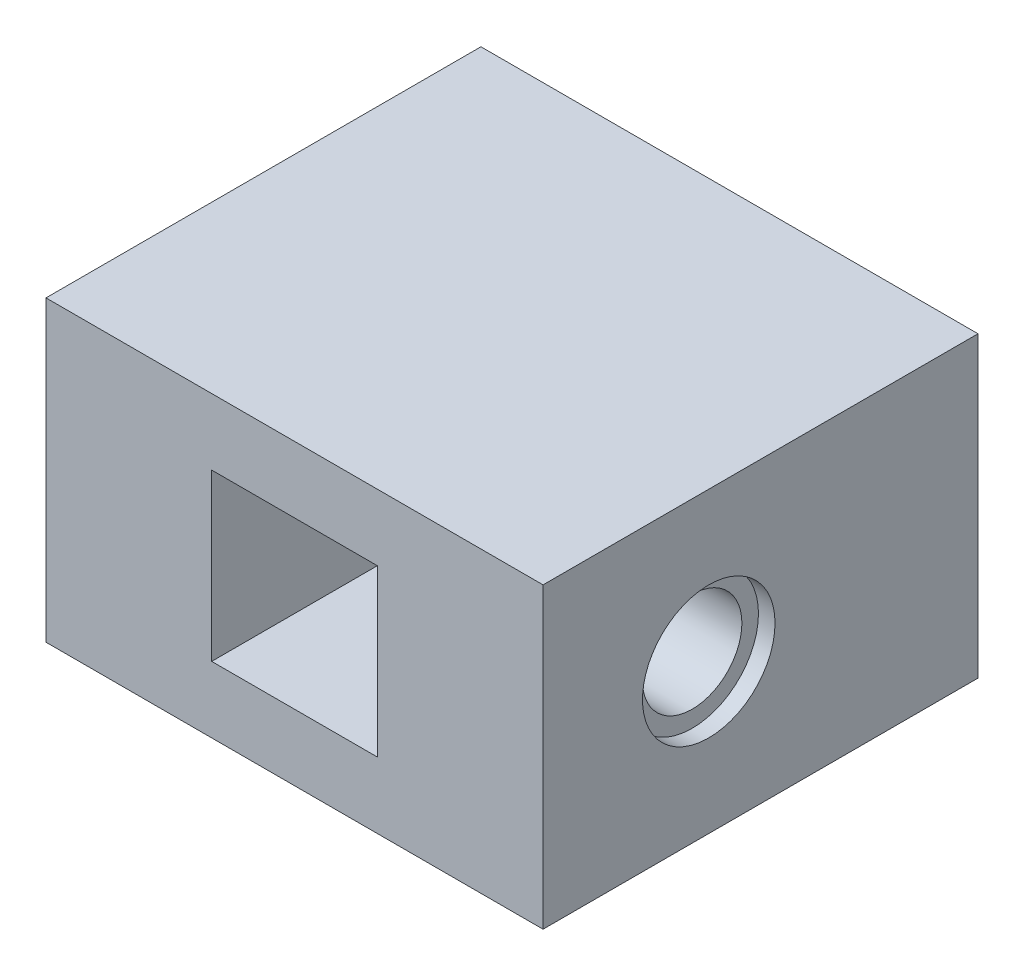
ISO-10303-21;
HEADER;
FILE_DESCRIPTION(('STEP AP214'),'2;1');
FILE_NAME('part.step','',(''),(''),'','','');
FILE_SCHEMA(('AUTOMOTIVE_DESIGN { 1 0 10303 214 1 1 1 1 }'));
ENDSEC;
DATA;
#1=APPLICATION_CONTEXT('core data for automotive mechanical design processes');
#2=APPLICATION_PROTOCOL_DEFINITION('international standard','automotive_design',2000,#1);
#3=PRODUCT_CONTEXT('',#1,'mechanical');
#4=PRODUCT('Part','Part','',(#3));
#5=PRODUCT_RELATED_PRODUCT_CATEGORY('part','',(#4));
#6=PRODUCT_DEFINITION_FORMATION('','',#4);
#7=PRODUCT_DEFINITION_CONTEXT('part definition',#1,'design');
#8=PRODUCT_DEFINITION('design','',#6,#7);
#9=PRODUCT_DEFINITION_SHAPE('','',#8);
#10=(LENGTH_UNIT() NAMED_UNIT(*) SI_UNIT(.MILLI.,.METRE.));
#11=(NAMED_UNIT(*) PLANE_ANGLE_UNIT() SI_UNIT($,.RADIAN.));
#12=(NAMED_UNIT(*) SI_UNIT($,.STERADIAN.) SOLID_ANGLE_UNIT());
#13=UNCERTAINTY_MEASURE_WITH_UNIT(LENGTH_MEASURE(1.E-05),#10,'distance_accuracy_value','');
#14=(GEOMETRIC_REPRESENTATION_CONTEXT(3) GLOBAL_UNCERTAINTY_ASSIGNED_CONTEXT((#13)) GLOBAL_UNIT_ASSIGNED_CONTEXT((#10,
#11,#12)) REPRESENTATION_CONTEXT('',''));
#15=CARTESIAN_POINT('',(0.,0.,0.));
#16=DIRECTION('',(0.,0.,1.));
#17=DIRECTION('',(1.,0.,0.));
#18=AXIS2_PLACEMENT_3D('',#15,#16,#17);
#19=CARTESIAN_POINT('',(-12.,14.4,8.));
#20=DIRECTION('',(1.,0.,0.));
#21=DIRECTION('',(0.,0.,-1.));
#22=AXIS2_PLACEMENT_3D('',#19,#20,#21);
#23=PLANE('',#22);
#24=DIRECTION('',(0.,0.,1.));
#25=VECTOR('',#24,1.);
#26=CARTESIAN_POINT('',(-12.,0.,8.));
#27=LINE('',#26,#25);
#28=CARTESIAN_POINT('',(-12.,0.,-13.));
#29=VERTEX_POINT('',#28);
#30=CARTESIAN_POINT('',(-12.,0.,8.));
#31=VERTEX_POINT('',#30);
#32=EDGE_CURVE('E164',#29,#31,#27,.T.);
#33=ORIENTED_EDGE('',*,*,#32,.T.);
#34=DIRECTION('',(0.,-1.,0.));
#35=VECTOR('',#34,1.);
#36=CARTESIAN_POINT('',(-12.,14.4,8.));
#37=LINE('',#36,#35);
#38=CARTESIAN_POINT('',(-12.,14.4,8.));
#39=VERTEX_POINT('',#38);
#40=EDGE_CURVE('E169',#39,#31,#37,.T.);
#41=ORIENTED_EDGE('',*,*,#40,.F.);
#42=DIRECTION('',(0.,0.,1.));
#43=VECTOR('',#42,1.);
#44=CARTESIAN_POINT('',(-12.,14.4,8.));
#45=LINE('',#44,#43);
#46=CARTESIAN_POINT('',(-12.,14.4,-13.));
#47=VERTEX_POINT('',#46);
#48=EDGE_CURVE('E155',#47,#39,#45,.T.);
#49=ORIENTED_EDGE('',*,*,#48,.F.);
#50=DIRECTION('',(0.,-1.,0.));
#51=VECTOR('',#50,1.);
#52=CARTESIAN_POINT('',(-12.,14.4,-13.));
#53=LINE('',#52,#51);
#54=EDGE_CURVE('E53',#47,#29,#53,.T.);
#55=ORIENTED_EDGE('',*,*,#54,.T.);
#56=EDGE_LOOP('',(#33,#41,#49,#55));
#57=FACE_BOUND('',#56,.T.);
#58=CARTESIAN_POINT('',(-12.,7.2,0.));
#59=DIRECTION('',(-1.,0.,0.));
#60=DIRECTION('',(0.,0.,1.));
#61=AXIS2_PLACEMENT_3D('',#58,#59,#60);
#62=CIRCLE('',#61,3.19999999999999);
#63=CARTESIAN_POINT('',(-12.,7.2,3.19999999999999));
#64=VERTEX_POINT('',#63);
#65=EDGE_CURVE('E345',#64,#64,#62,.T.);
#66=ORIENTED_EDGE('',*,*,#65,.F.);
#67=EDGE_LOOP('',(#66));
#68=FACE_BOUND('',#67,.T.);
#69=ADVANCED_FACE('F45',(#57,#68),#23,.F.);
#70=CARTESIAN_POINT('',(-12.,14.4,-13.));
#71=DIRECTION('',(0.,0.,1.));
#72=DIRECTION('',(1.,0.,0.));
#73=AXIS2_PLACEMENT_3D('',#70,#71,#72);
#74=PLANE('',#73);
#75=DIRECTION('',(-1.,0.,0.));
#76=VECTOR('',#75,1.);
#77=CARTESIAN_POINT('',(-12.,0.,-13.));
#78=LINE('',#77,#76);
#79=CARTESIAN_POINT('',(12.,0.,-13.));
#80=VERTEX_POINT('',#79);
#81=EDGE_CURVE('E162',#80,#29,#78,.T.);
#82=ORIENTED_EDGE('',*,*,#81,.T.);
#83=ORIENTED_EDGE('',*,*,#54,.F.);
#84=DIRECTION('',(-1.,0.,0.));
#85=VECTOR('',#84,1.);
#86=CARTESIAN_POINT('',(-12.,14.4,-13.));
#87=LINE('',#86,#85);
#88=CARTESIAN_POINT('',(12.,14.4,-13.));
#89=VERTEX_POINT('',#88);
#90=EDGE_CURVE('E152',#89,#47,#87,.T.);
#91=ORIENTED_EDGE('',*,*,#90,.F.);
#92=DIRECTION('',(0.,-1.,0.));
#93=VECTOR('',#92,1.);
#94=CARTESIAN_POINT('',(12.,14.4,-13.));
#95=LINE('',#94,#93);
#96=EDGE_CURVE('E11',#89,#80,#95,.T.);
#97=ORIENTED_EDGE('',*,*,#96,.T.);
#98=EDGE_LOOP('',(#82,#83,#91,#97));
#99=FACE_BOUND('',#98,.T.);
#100=DIRECTION('',(0.,-1.,0.));
#101=VECTOR('',#100,1.);
#102=CARTESIAN_POINT('',(-4.,3.2,-13.));
#103=LINE('',#102,#101);
#104=CARTESIAN_POINT('',(-4.,11.2,-13.));
#105=VERTEX_POINT('',#104);
#106=CARTESIAN_POINT('',(-4.,3.2,-13.));
#107=VERTEX_POINT('',#106);
#108=EDGE_CURVE('E60',#105,#107,#103,.T.);
#109=ORIENTED_EDGE('',*,*,#108,.T.);
#110=DIRECTION('',(1.,0.,0.));
#111=VECTOR('',#110,1.);
#112=CARTESIAN_POINT('',(-4.,3.2,-13.));
#113=LINE('',#112,#111);
#114=CARTESIAN_POINT('',(4.,3.2,-13.));
#115=VERTEX_POINT('',#114);
#116=EDGE_CURVE('E125',#107,#115,#113,.T.);
#117=ORIENTED_EDGE('',*,*,#116,.T.);
#118=DIRECTION('',(0.,1.,0.));
#119=VECTOR('',#118,1.);
#120=CARTESIAN_POINT('',(4.,3.2,-13.));
#121=LINE('',#120,#119);
#122=CARTESIAN_POINT('',(4.,11.2,-13.));
#123=VERTEX_POINT('',#122);
#124=EDGE_CURVE('E141',#115,#123,#121,.T.);
#125=ORIENTED_EDGE('',*,*,#124,.T.);
#126=DIRECTION('',(-1.,0.,0.));
#127=VECTOR('',#126,1.);
#128=CARTESIAN_POINT('',(-4.,11.2,-13.));
#129=LINE('',#128,#127);
#130=EDGE_CURVE('E119',#123,#105,#129,.T.);
#131=ORIENTED_EDGE('',*,*,#130,.T.);
#132=EDGE_LOOP('',(#109,#117,#125,#131));
#133=FACE_BOUND('',#132,.T.);
#134=ADVANCED_FACE('F191',(#99,#133),#74,.F.);
#135=CARTESIAN_POINT('',(-12.,14.4,8.));
#136=DIRECTION('',(0.,0.,-1.));
#137=DIRECTION('',(-1.,0.,0.));
#138=AXIS2_PLACEMENT_3D('',#135,#136,#137);
#139=PLANE('',#138);
#140=DIRECTION('',(1.,0.,0.));
#141=VECTOR('',#140,1.);
#142=CARTESIAN_POINT('',(-12.,0.,8.));
#143=LINE('',#142,#141);
#144=CARTESIAN_POINT('',(12.,0.,8.));
#145=VERTEX_POINT('',#144);
#146=EDGE_CURVE('E153',#31,#145,#143,.T.);
#147=ORIENTED_EDGE('',*,*,#146,.T.);
#148=DIRECTION('',(0.,-1.,0.));
#149=VECTOR('',#148,1.);
#150=CARTESIAN_POINT('',(12.,14.4,8.));
#151=LINE('',#150,#149);
#152=CARTESIAN_POINT('',(12.,14.4,8.));
#153=VERTEX_POINT('',#152);
#154=EDGE_CURVE('E159',#153,#145,#151,.T.);
#155=ORIENTED_EDGE('',*,*,#154,.F.);
#156=DIRECTION('',(1.,0.,0.));
#157=VECTOR('',#156,1.);
#158=CARTESIAN_POINT('',(-12.,14.4,8.));
#159=LINE('',#158,#157);
#160=EDGE_CURVE('E157',#39,#153,#159,.T.);
#161=ORIENTED_EDGE('',*,*,#160,.F.);
#162=ORIENTED_EDGE('',*,*,#40,.T.);
#163=EDGE_LOOP('',(#147,#155,#161,#162));
#164=FACE_BOUND('',#163,.T.);
#165=DIRECTION('',(0.,-1.,0.));
#166=VECTOR('',#165,1.);
#167=CARTESIAN_POINT('',(-4.,3.2,8.));
#168=LINE('',#167,#166);
#169=CARTESIAN_POINT('',(-4.,11.2,8.));
#170=VERTEX_POINT('',#169);
#171=CARTESIAN_POINT('',(-4.,3.2,8.));
#172=VERTEX_POINT('',#171);
#173=EDGE_CURVE('E110',#170,#172,#168,.T.);
#174=ORIENTED_EDGE('',*,*,#173,.F.);
#175=DIRECTION('',(-1.,0.,0.));
#176=VECTOR('',#175,1.);
#177=CARTESIAN_POINT('',(-4.,11.2,8.));
#178=LINE('',#177,#176);
#179=CARTESIAN_POINT('',(4.,11.2,8.));
#180=VERTEX_POINT('',#179);
#181=EDGE_CURVE('E133',#180,#170,#178,.T.);
#182=ORIENTED_EDGE('',*,*,#181,.F.);
#183=DIRECTION('',(0.,1.,0.));
#184=VECTOR('',#183,1.);
#185=CARTESIAN_POINT('',(4.,3.2,8.));
#186=LINE('',#185,#184);
#187=CARTESIAN_POINT('',(4.,3.2,8.));
#188=VERTEX_POINT('',#187);
#189=EDGE_CURVE('E131',#188,#180,#186,.T.);
#190=ORIENTED_EDGE('',*,*,#189,.F.);
#191=DIRECTION('',(1.,0.,0.));
#192=VECTOR('',#191,1.);
#193=CARTESIAN_POINT('',(-4.,3.2,8.));
#194=LINE('',#193,#192);
#195=EDGE_CURVE('E118',#172,#188,#194,.T.);
#196=ORIENTED_EDGE('',*,*,#195,.F.);
#197=EDGE_LOOP('',(#174,#182,#190,#196));
#198=FACE_BOUND('',#197,.T.);
#199=ADVANCED_FACE('F130',(#164,#198),#139,.F.);
#200=CARTESIAN_POINT('',(12.,14.4,8.));
#201=DIRECTION('',(-1.,0.,0.));
#202=DIRECTION('',(0.,0.,1.));
#203=AXIS2_PLACEMENT_3D('',#200,#201,#202);
#204=PLANE('',#203);
#205=CARTESIAN_POINT('',(12.,7.2,0.));
#206=DIRECTION('',(1.,0.,0.));
#207=DIRECTION('',(0.,0.,-1.));
#208=AXIS2_PLACEMENT_3D('',#205,#206,#207);
#209=CIRCLE('',#208,3.19999999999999);
#210=CARTESIAN_POINT('',(12.,7.2,-3.19999999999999));
#211=VERTEX_POINT('',#210);
#212=EDGE_CURVE('E363',#211,#211,#209,.T.);
#213=ORIENTED_EDGE('',*,*,#212,.F.);
#214=EDGE_LOOP('',(#213));
#215=FACE_BOUND('',#214,.T.);
#216=DIRECTION('',(0.,0.,-1.));
#217=VECTOR('',#216,1.);
#218=CARTESIAN_POINT('',(12.,0.,8.));
#219=LINE('',#218,#217);
#220=EDGE_CURVE('E126',#145,#80,#219,.T.);
#221=ORIENTED_EDGE('',*,*,#220,.T.);
#222=ORIENTED_EDGE('',*,*,#96,.F.);
#223=DIRECTION('',(0.,0.,-1.));
#224=VECTOR('',#223,1.);
#225=CARTESIAN_POINT('',(12.,14.4,8.));
#226=LINE('',#225,#224);
#227=EDGE_CURVE('E149',#153,#89,#226,.T.);
#228=ORIENTED_EDGE('',*,*,#227,.F.);
#229=ORIENTED_EDGE('',*,*,#154,.T.);
#230=EDGE_LOOP('',(#221,#222,#228,#229));
#231=FACE_BOUND('',#230,.T.);
#232=ADVANCED_FACE('F47',(#215,#231),#204,.F.);
#233=CARTESIAN_POINT('',(0.,14.4,0.));
#234=DIRECTION('',(0.,-1.,0.));
#235=DIRECTION('',(0.,0.,-1.));
#236=AXIS2_PLACEMENT_3D('',#233,#234,#235);
#237=PLANE('',#236);
#238=ORIENTED_EDGE('',*,*,#227,.T.);
#239=ORIENTED_EDGE('',*,*,#90,.T.);
#240=ORIENTED_EDGE('',*,*,#48,.T.);
#241=ORIENTED_EDGE('',*,*,#160,.T.);
#242=EDGE_LOOP('',(#238,#239,#240,#241));
#243=FACE_BOUND('',#242,.T.);
#244=ADVANCED_FACE('F190',(#243),#237,.F.);
#245=CARTESIAN_POINT('',(0.,0.,0.));
#246=DIRECTION('',(0.,-1.,0.));
#247=DIRECTION('',(0.,0.,-1.));
#248=AXIS2_PLACEMENT_3D('',#245,#246,#247);
#249=PLANE('',#248);
#250=ORIENTED_EDGE('',*,*,#220,.F.);
#251=ORIENTED_EDGE('',*,*,#146,.F.);
#252=ORIENTED_EDGE('',*,*,#32,.F.);
#253=ORIENTED_EDGE('',*,*,#81,.F.);
#254=EDGE_LOOP('',(#250,#251,#252,#253));
#255=FACE_BOUND('',#254,.T.);
#256=ADVANCED_FACE('F182',(#255),#249,.T.);
#257=CARTESIAN_POINT('',(-4.,3.2,8.));
#258=DIRECTION('',(1.,0.,0.));
#259=DIRECTION('',(0.,0.,-1.));
#260=AXIS2_PLACEMENT_3D('',#257,#258,#259);
#261=PLANE('',#260);
#262=CARTESIAN_POINT('',(-4.,7.2,0.));
#263=DIRECTION('',(1.,0.,0.));
#264=DIRECTION('',(0.,0.,-1.));
#265=AXIS2_PLACEMENT_3D('',#262,#263,#264);
#266=CIRCLE('',#265,2.4);
#267=CARTESIAN_POINT('',(-4.,7.2,-2.4));
#268=VERTEX_POINT('',#267);
#269=EDGE_CURVE('E139',#268,#268,#266,.T.);
#270=ORIENTED_EDGE('',*,*,#269,.F.);
#271=EDGE_LOOP('',(#270));
#272=FACE_BOUND('',#271,.T.);
#273=ORIENTED_EDGE('',*,*,#108,.F.);
#274=DIRECTION('',(0.,0.,-1.));
#275=VECTOR('',#274,1.);
#276=CARTESIAN_POINT('',(-4.,11.2,8.));
#277=LINE('',#276,#275);
#278=EDGE_CURVE('E114',#170,#105,#277,.T.);
#279=ORIENTED_EDGE('',*,*,#278,.F.);
#280=ORIENTED_EDGE('',*,*,#173,.T.);
#281=DIRECTION('',(0.,0.,-1.));
#282=VECTOR('',#281,1.);
#283=CARTESIAN_POINT('',(-4.,3.2,8.));
#284=LINE('',#283,#282);
#285=EDGE_CURVE('E113',#172,#107,#284,.T.);
#286=ORIENTED_EDGE('',*,*,#285,.T.);
#287=EDGE_LOOP('',(#273,#279,#280,#286));
#288=FACE_BOUND('',#287,.T.);
#289=ADVANCED_FACE('F112',(#272,#288),#261,.T.);
#290=CARTESIAN_POINT('',(-4.,3.2,8.));
#291=DIRECTION('',(0.,1.,0.));
#292=DIRECTION('',(0.,0.,1.));
#293=AXIS2_PLACEMENT_3D('',#290,#291,#292);
#294=PLANE('',#293);
#295=ORIENTED_EDGE('',*,*,#116,.F.);
#296=ORIENTED_EDGE('',*,*,#285,.F.);
#297=ORIENTED_EDGE('',*,*,#195,.T.);
#298=DIRECTION('',(0.,0.,-1.));
#299=VECTOR('',#298,1.);
#300=CARTESIAN_POINT('',(4.,3.2,8.));
#301=LINE('',#300,#299);
#302=EDGE_CURVE('E127',#188,#115,#301,.T.);
#303=ORIENTED_EDGE('',*,*,#302,.T.);
#304=EDGE_LOOP('',(#295,#296,#297,#303));
#305=FACE_BOUND('',#304,.T.);
#306=ADVANCED_FACE('F122',(#305),#294,.T.);
#307=CARTESIAN_POINT('',(4.,3.2,8.));
#308=DIRECTION('',(-1.,0.,0.));
#309=DIRECTION('',(0.,0.,1.));
#310=AXIS2_PLACEMENT_3D('',#307,#308,#309);
#311=PLANE('',#310);
#312=CARTESIAN_POINT('',(4.,7.2,0.));
#313=DIRECTION('',(-1.,0.,0.));
#314=DIRECTION('',(0.,0.,1.));
#315=AXIS2_PLACEMENT_3D('',#312,#313,#314);
#316=CIRCLE('',#315,2.4);
#317=CARTESIAN_POINT('',(4.,7.2,2.4));
#318=VERTEX_POINT('',#317);
#319=EDGE_CURVE('E349',#318,#318,#316,.T.);
#320=ORIENTED_EDGE('',*,*,#319,.F.);
#321=EDGE_LOOP('',(#320));
#322=FACE_BOUND('',#321,.T.);
#323=ORIENTED_EDGE('',*,*,#124,.F.);
#324=ORIENTED_EDGE('',*,*,#302,.F.);
#325=ORIENTED_EDGE('',*,*,#189,.T.);
#326=DIRECTION('',(0.,0.,-1.));
#327=VECTOR('',#326,1.);
#328=CARTESIAN_POINT('',(4.,11.2,8.));
#329=LINE('',#328,#327);
#330=EDGE_CURVE('E68',#180,#123,#329,.T.);
#331=ORIENTED_EDGE('',*,*,#330,.T.);
#332=EDGE_LOOP('',(#323,#324,#325,#331));
#333=FACE_BOUND('',#332,.T.);
#334=ADVANCED_FACE('F198',(#322,#333),#311,.T.);
#335=CARTESIAN_POINT('',(-4.,11.2,8.));
#336=DIRECTION('',(0.,-1.,0.));
#337=DIRECTION('',(0.,0.,-1.));
#338=AXIS2_PLACEMENT_3D('',#335,#336,#337);
#339=PLANE('',#338);
#340=ORIENTED_EDGE('',*,*,#130,.F.);
#341=ORIENTED_EDGE('',*,*,#330,.F.);
#342=ORIENTED_EDGE('',*,*,#181,.T.);
#343=ORIENTED_EDGE('',*,*,#278,.T.);
#344=EDGE_LOOP('',(#340,#341,#342,#343));
#345=FACE_BOUND('',#344,.T.);
#346=ADVANCED_FACE('F195',(#345),#339,.T.);
#347=CARTESIAN_POINT('',(-12.,7.2,0.));
#348=DIRECTION('',(-1.,0.,0.));
#349=DIRECTION('',(0.,0.,1.));
#350=AXIS2_PLACEMENT_3D('',#347,#348,#349);
#351=CYLINDRICAL_SURFACE('',#350,2.4);
#352=CARTESIAN_POINT('',(-11.2,7.2,0.));
#353=DIRECTION('',(-1.,0.,0.));
#354=DIRECTION('',(0.,0.,1.));
#355=AXIS2_PLACEMENT_3D('',#352,#353,#354);
#356=CIRCLE('',#355,2.4);
#357=CARTESIAN_POINT('',(-11.2,7.2,2.4));
#358=VERTEX_POINT('',#357);
#359=EDGE_CURVE('E341',#358,#358,#356,.T.);
#360=ORIENTED_EDGE('',*,*,#359,.T.);
#361=EDGE_LOOP('',(#360));
#362=FACE_BOUND('',#361,.T.);
#363=ORIENTED_EDGE('',*,*,#269,.T.);
#364=EDGE_LOOP('',(#363));
#365=FACE_BOUND('',#364,.T.);
#366=ADVANCED_FACE('F197',(#362,#365),#351,.F.);
#367=CARTESIAN_POINT('',(-11.2,9.6,0.));
#368=DIRECTION('',(1.,0.,0.));
#369=DIRECTION('',(0.,0.,-1.));
#370=AXIS2_PLACEMENT_3D('',#367,#368,#369);
#371=PLANE('',#370);
#372=ORIENTED_EDGE('',*,*,#359,.F.);
#373=EDGE_LOOP('',(#372));
#374=FACE_BOUND('',#373,.T.);
#375=CARTESIAN_POINT('',(-11.2,7.2,0.));
#376=DIRECTION('',(-1.,0.,0.));
#377=DIRECTION('',(0.,0.,1.));
#378=AXIS2_PLACEMENT_3D('',#375,#376,#377);
#379=CIRCLE('',#378,3.2);
#380=CARTESIAN_POINT('',(-11.2,7.2,3.2));
#381=VERTEX_POINT('',#380);
#382=EDGE_CURVE('E344',#381,#381,#379,.T.);
#383=ORIENTED_EDGE('',*,*,#382,.T.);
#384=EDGE_LOOP('',(#383));
#385=FACE_BOUND('',#384,.T.);
#386=ADVANCED_FACE('F205',(#374,#385),#371,.F.);
#387=CARTESIAN_POINT('',(-12.,7.2,0.));
#388=DIRECTION('',(-1.,0.,0.));
#389=DIRECTION('',(0.,0.,1.));
#390=AXIS2_PLACEMENT_3D('',#387,#388,#389);
#391=CYLINDRICAL_SURFACE('',#390,3.2);
#392=ORIENTED_EDGE('',*,*,#382,.F.);
#393=EDGE_LOOP('',(#392));
#394=FACE_BOUND('',#393,.T.);
#395=ORIENTED_EDGE('',*,*,#65,.T.);
#396=EDGE_LOOP('',(#395));
#397=FACE_BOUND('',#396,.T.);
#398=ADVANCED_FACE('F262',(#394,#397),#391,.F.);
#399=CARTESIAN_POINT('',(12.,7.2,0.));
#400=DIRECTION('',(1.,0.,0.));
#401=DIRECTION('',(0.,0.,-1.));
#402=AXIS2_PLACEMENT_3D('',#399,#400,#401);
#403=CYLINDRICAL_SURFACE('',#402,2.4);
#404=CARTESIAN_POINT('',(11.2,7.2,0.));
#405=DIRECTION('',(1.,0.,0.));
#406=DIRECTION('',(0.,0.,-1.));
#407=AXIS2_PLACEMENT_3D('',#404,#405,#406);
#408=CIRCLE('',#407,2.4);
#409=CARTESIAN_POINT('',(11.2,7.2,-2.4));
#410=VERTEX_POINT('',#409);
#411=EDGE_CURVE('E357',#410,#410,#408,.T.);
#412=ORIENTED_EDGE('',*,*,#411,.T.);
#413=EDGE_LOOP('',(#412));
#414=FACE_BOUND('',#413,.T.);
#415=ORIENTED_EDGE('',*,*,#319,.T.);
#416=EDGE_LOOP('',(#415));
#417=FACE_BOUND('',#416,.T.);
#418=ADVANCED_FACE('F271',(#414,#417),#403,.F.);
#419=CARTESIAN_POINT('',(11.2,9.6,0.));
#420=DIRECTION('',(-1.,0.,0.));
#421=DIRECTION('',(0.,0.,1.));
#422=AXIS2_PLACEMENT_3D('',#419,#420,#421);
#423=PLANE('',#422);
#424=ORIENTED_EDGE('',*,*,#411,.F.);
#425=EDGE_LOOP('',(#424));
#426=FACE_BOUND('',#425,.T.);
#427=CARTESIAN_POINT('',(11.2,7.2,0.));
#428=DIRECTION('',(1.,0.,0.));
#429=DIRECTION('',(0.,0.,-1.));
#430=AXIS2_PLACEMENT_3D('',#427,#428,#429);
#431=CIRCLE('',#430,3.2);
#432=CARTESIAN_POINT('',(11.2,7.2,-3.2));
#433=VERTEX_POINT('',#432);
#434=EDGE_CURVE('E360',#433,#433,#431,.T.);
#435=ORIENTED_EDGE('',*,*,#434,.T.);
#436=EDGE_LOOP('',(#435));
#437=FACE_BOUND('',#436,.T.);
#438=ADVANCED_FACE('F275',(#426,#437),#423,.F.);
#439=CARTESIAN_POINT('',(12.,7.2,0.));
#440=DIRECTION('',(1.,0.,0.));
#441=DIRECTION('',(0.,0.,-1.));
#442=AXIS2_PLACEMENT_3D('',#439,#440,#441);
#443=CYLINDRICAL_SURFACE('',#442,3.2);
#444=ORIENTED_EDGE('',*,*,#434,.F.);
#445=EDGE_LOOP('',(#444));
#446=FACE_BOUND('',#445,.T.);
#447=ORIENTED_EDGE('',*,*,#212,.T.);
#448=EDGE_LOOP('',(#447));
#449=FACE_BOUND('',#448,.T.);
#450=ADVANCED_FACE('F284',(#446,#449),#443,.F.);
#451=CLOSED_SHELL('',(#69,#134,#199,#232,#244,#256,#289,#306,#334,#346,#366,#386,#398,#418,#438,#450));
#452=MANIFOLD_SOLID_BREP('B2',#451);
#453=ADVANCED_BREP_SHAPE_REPRESENTATION('',(#18,#452),#14);
#454=SHAPE_DEFINITION_REPRESENTATION(#9,#453);
ENDSEC;
END-ISO-10303-21;
